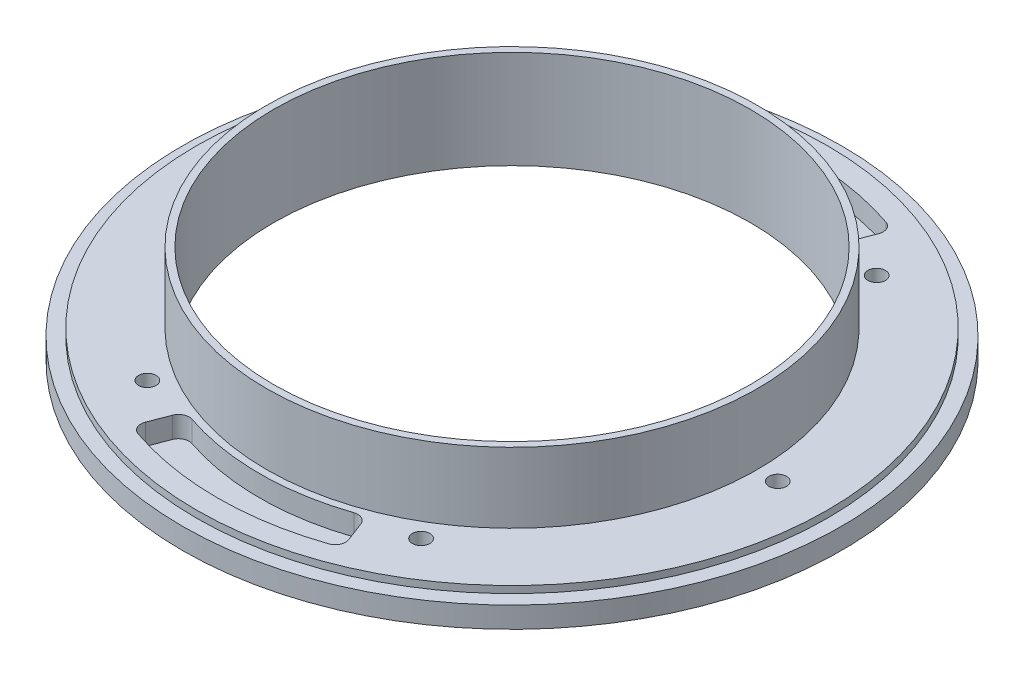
from build123d import *

# Parameters (mm, degrees)
SKETCH_1_R          = 47
EXTRUDE_1_DEPTH     = 3
SKETCH_2_R          = 45
EXTRUDE_2_DEPTH     = 1
SKETCH_3_R          = 35
SKETCH_3_R_2        = 34
EXTRUDE_3_DEPTH     = 10
SKETCH_4_R          = 34
CUT_EXTRUDE_1_DEPTH = 68.216069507
SKETCH_6_R          = 1.25
CUT_EXTRUDE_2_DEPTH = 72.9322598
SKETCH_7_R          = 2.25
CUT_EXTRUDE_3_DEPTH = 2
CUT_EXTRUDE_4_DEPTH = 3
FILLET_1_R          = 1.5


with BuildPart() as part:
    # Sketch 1 → Extrude 1 (new body)
    with BuildSketch(Plane(origin=(0, 0, 0), x_dir=(1, 0, 0), z_dir=(0, 1, 0))):
        with Locations(Location((0, 0, 0), (0, 0, 270))):
            Circle(SKETCH_1_R)
    extrude(amount=EXTRUDE_1_DEPTH)

    # Sketch 2 → Extrude 2 (add)
    with BuildSketch(Plane(origin=(0, 3, 0), x_dir=(1, 0, 0), z_dir=(0, 1, 0))):
        with Locations(Location((0, 0, 0), (0, 0, 270))):
            Circle(SKETCH_2_R)
    extrude(amount=EXTRUDE_2_DEPTH)

    # Sketch 3 → Extrude 3 (add)
    with BuildSketch(Plane(origin=(0, 4, 0), x_dir=(1, 0, 0), z_dir=(0, 1, 0))):
        with Locations(Location((0, 0, 0), (0, 0, 270))):
            Circle(SKETCH_3_R)
        with Locations(Location((0, 0, 0), (0, 0, 270))):
            Circle(SKETCH_3_R_2, mode=Mode.SUBTRACT)
    extrude(amount=EXTRUDE_3_DEPTH)

    # Sketch 4 → Cut-Extrude 1 (cut, through all)
    with BuildSketch(Plane(origin=(0, 4, 0), x_dir=(1, 0, 0), z_dir=(0, 1, 0))):
        with Locations(Location((0, 0, 0), (0, 0, 270))):
            Circle(SKETCH_4_R)
    extrude(amount=-CUT_EXTRUDE_1_DEPTH, mode=Mode.SUBTRACT)

    # Sketch 6 → Cut-Extrude 2 (cut, through all)
    with BuildSketch(Plane(origin=(0, 27.5, 0), x_dir=(1, 0, 0), z_dir=(0, 1, 0))):
        with Locations(Location((-19.519943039, 32.486640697, 0), (0, 0, 270))):
            Circle(SKETCH_6_R)
        with Locations(Location((19.519943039, 32.486640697, 0), (0, 0, 270))):
            Circle(SKETCH_6_R)
        with Locations(Location((-37.9, 0, 0), (0, 0, 270))):
            Circle(SKETCH_6_R)
        with Locations(Location((37.9, 0, 0), (0, 0, 270))):
            Circle(SKETCH_6_R)
        with Locations(Location((-19.519943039, -32.486640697, 0), (0, 0, 270))):
            Circle(SKETCH_6_R)
        with Locations(Location((19.519943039, -32.486640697, 0), (0, 0, 270))):
            Circle(SKETCH_6_R)
    extrude(amount=-CUT_EXTRUDE_2_DEPTH, mode=Mode.SUBTRACT)

    # Sketch 7 → Cut-Extrude 3 (cut)
    with BuildSketch(Plane.XZ):
        with Locations(Location((-19.519943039, 32.486640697, 0), (0, 0, 270))):
            Circle(SKETCH_7_R)
        with Locations(Location((-37.9, 0, 0), (0, 0, 270))):
            Circle(SKETCH_7_R)
        with Locations(Location((19.519943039, 32.486640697, 0), (0, 0, 270))):
            Circle(SKETCH_7_R)
        with Locations(Location((37.9, 0, 0), (0, 0, 270))):
            Circle(SKETCH_7_R)
        with Locations(Location((19.519943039, -32.486640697, 0), (0, 0, 270))):
            Circle(SKETCH_7_R)
        with Locations(Location((-19.519943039, -32.486640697, 0), (0, 0, 270))):
            Circle(SKETCH_7_R)
    extrude(amount=-CUT_EXTRUDE_3_DEPTH, mode=Mode.SUBTRACT)

    # Sketch 8 → Cut-Extrude 4 (cut)
    with BuildSketch(Plane(origin=(0, 4, 0), x_dir=(1, 0, 0), z_dir=(0, 1, 0))):
        with BuildLine():
            Line((-15.051453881, 39.210377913), (-12.901246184, 33.608895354))
            ThreePointArc((-12.901246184, 33.608895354), (0, 36), (12.901246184, 33.608895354))
            Line((12.901246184, 33.608895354), (15.051453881, 39.210377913))
            ThreePointArc((15.051453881, 39.210377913), (0, 42), (-15.051453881, 39.210377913))
        make_face()
        with BuildLine():
            Line((15.051453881, -39.210377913), (12.901246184, -33.608895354))
            ThreePointArc((12.901246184, -33.608895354), (0, -36), (-12.901246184, -33.608895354))
            Line((-12.901246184, -33.608895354), (-15.051453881, -39.210377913))
            ThreePointArc((-15.051453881, -39.210377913), (0, -42), (15.051453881, -39.210377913))
        make_face()
    extrude(amount=-CUT_EXTRUDE_4_DEPTH, mode=Mode.SUBTRACT)

    # Fillet 1
    fillet_1_edges = [part.edges().sort_by_distance(p)[0] for p in [
        (-15.051453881, 2.5, 39.210377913),
        (-12.901246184, 2.5, 33.608895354),
        (12.901246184, 2.5, 33.608895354),
        (15.051453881, 2.5, 39.210377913),
        (15.051453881, 2.5, -39.210377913),
        (12.901246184, 2.5, -33.608895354),
        (-12.901246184, 2.5, -33.608895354),
        (-15.051453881, 2.5, -39.210377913),
    ]]
    fillet(fillet_1_edges, radius=FILLET_1_R)


solid = part.part
